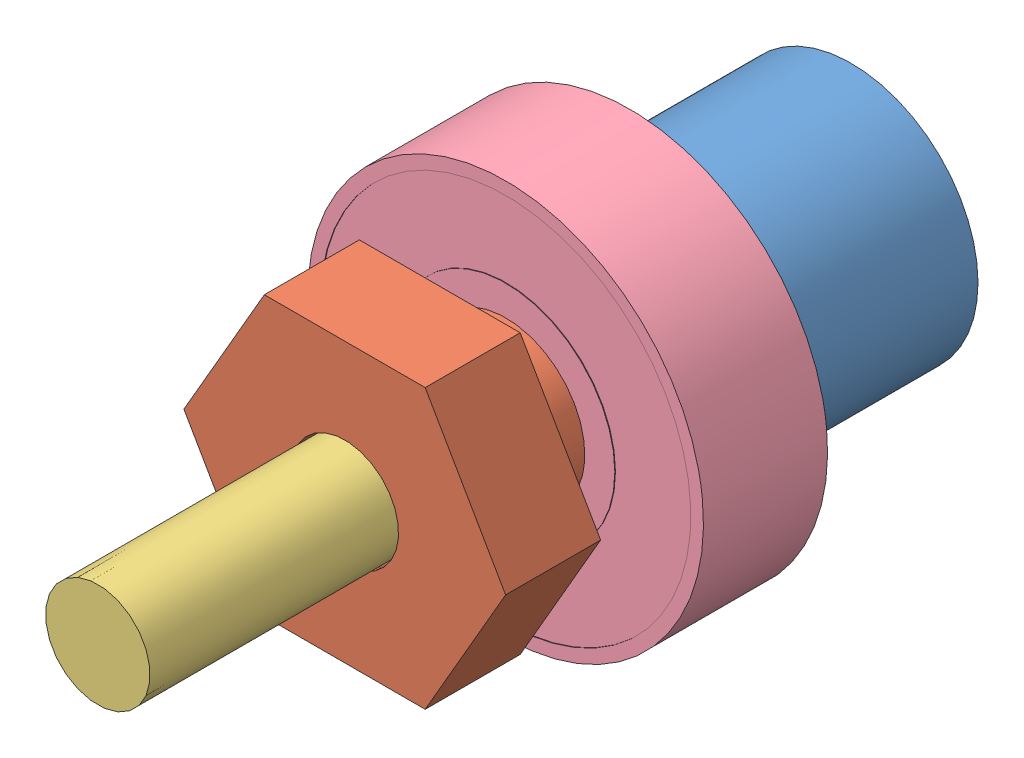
SolidWorks assembly Assem1.sldasm, configuration Default (file format 10000). Lengths in mm.
Overall size (18.25 18.25 30.23).
4 component instances, 4 part files, 7 mates.
Components (placement in the parent):
- Front Axle Part 1-1: Front Axle Part 1.SLDPRT [Default] at (6.3358 6.811 9.0117) size (10.16 10.16 11.43)
- Wheel Mount-1: Wheel Mount.SLDPRT [Default] at (6.3358 6.811 17.9017) x (-0.5 -0.866025 0) z (0 0 1) size (12.9 11.18 13.97)
- 8-32 1-1: 8-32 1.SLDPRT [Default] at (6.3358 6.811 6.4717) x (-0.923728 -0.383049 0) z (0 0 -1) size (6.86 6.86 29.21)
- Bearing-1: Bearing.SLDPRT [Default] at (6.3358 6.811 12.7709) x (0.986602 0.163143 0) z (0 0 1) size (15.88 15.88 4.98)
Mates (geometry in assembly coordinates):
- Concentric1: concentric aligned: cylinder of Front Axle Part 1-1 through (6.3358 6.811 6.4717) axis (0 0 -1) radius 3.429; cylinder of 8-32 1-1 through (6.3358 6.811 -8.6315) axis (0 0 -1) radius 2.0955
- Concentric2: concentric: cylinder of Front Axle Part 1-1 through (6.3358 6.811 10.2817) axis (0 0 -1) radius 2.159; cylinder of Wheel Mount-1 through (6.3358 6.811 36.09) axis (0 0 1) radius 2.159
- Coincident1: coincident: plane of Front Axle Part 1-1 through (6.9708 5.7111 10.2817) normal (-0.5 0.866025 0); plane of Wheel Mount-1 through (4.4507 4.2562 25.93) normal (0.5 -0.866025 0)
- Concentric3: concentric aligned: cylinder of 8-32 1-1 through (6.3358 6.811 31.6177) axis (0 0 -1) radius 2.0955; cylinder of Bearing-1 through (6.3358 6.811 15.2601) axis (0 0 -1) radius 3.175
- Coincident2: coincident anti-aligned: circle of Front Axle Part 1-1; plane of Bearing-1 through (6.3358 6.811 10.2817) normal (0 0 -1)
- Coincident3: coincident anti-aligned: plane of Front Axle Part 1-1 through (6.3358 6.811 7.7417) normal (0 0 1); plane of Wheel Mount-1 through (6.3358 6.811 7.7417) normal (0 0 -1)
- Coincident4: coincident anti-aligned: plane of Front Axle Part 1-1 through (6.3358 6.811 6.4717) normal (0 0 -1); plane of 8-32 1-1 through (6.3358 6.811 6.4717) normal (0 0 1)
